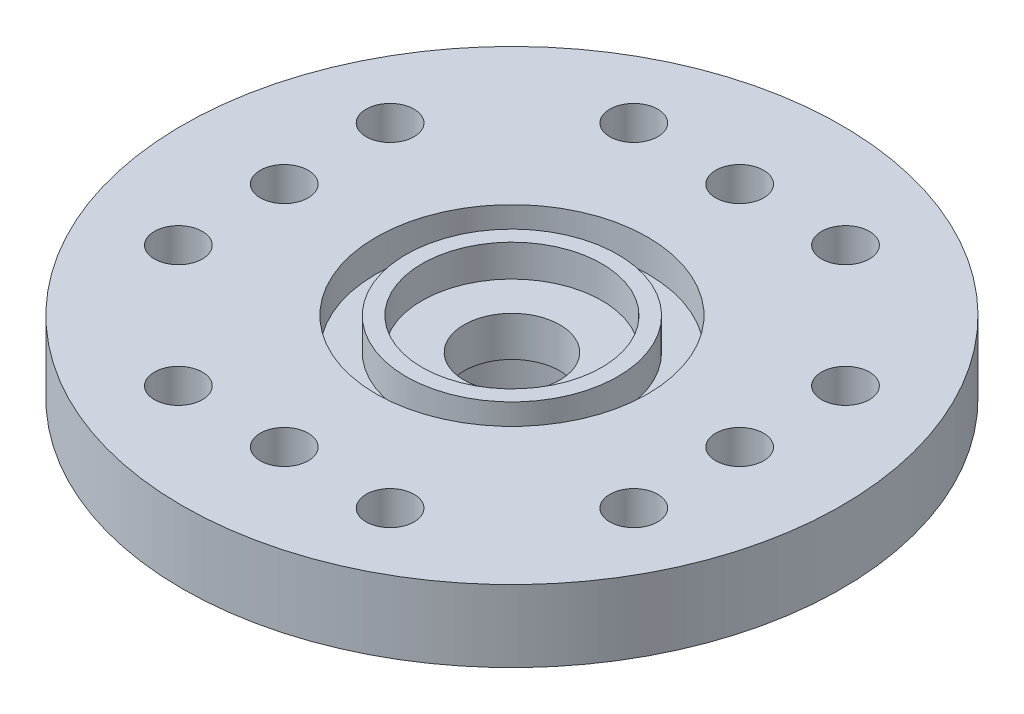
from build123d import *

# Parameters (mm, degrees)
SKETCH1_R           = 10.4775
SKETCH1_R_2         = 0.762
SKETCH1_R_3         = 1.524
BOSS_EXTRUDE1_DEPTH = 2.286
CUT_EXTRUDE1_START  = -1.016
SKETCH2_R           = 4.318
SKETCH2_R_2         = 3.3655
SKETCH2_R_3         = 2.8575
SKETCH2_R_4         = 1.524
CUT_EXTRUDE1_DEPTH  = 1.016
SKETCH3_R           = 4.3815
SKETCH3_R_2         = 3.175
BOSS_EXTRUDE2_DEPTH = 3.048


with BuildPart() as part:
    # Sketch1 → Boss-Extrude1 (new body)
    with BuildSketch(Plane(origin=(0, 0, 0), x_dir=(1, 0, 0), z_dir=(0, 1, 0))):
        with Locations(Location((0, 0, 0), (0, 0, 270))):
            Circle(SKETCH1_R)
        with Locations(Location((0, 7.239, 0), (0, 0, 270))):
            Circle(SKETCH1_R_2, mode=Mode.SUBTRACT)
        with Locations(Location((3.3655, 7.239, 0), (0, 0, 270))):
            Circle(SKETCH1_R_2, mode=Mode.SUBTRACT)
        with Locations(Location((-3.3655, 7.239, 0), (0, 0, 270))):
            Circle(SKETCH1_R_2, mode=Mode.SUBTRACT)
        with Locations(Location((0, 0, 0), (0, 0, 270))):
            Circle(SKETCH1_R_3, mode=Mode.SUBTRACT)
        with Locations(Location((7.239, -3.3655, 0), (0, 0, 270))):
            Circle(SKETCH1_R_2, mode=Mode.SUBTRACT)
        with Locations(Location((7.239, 0, 0), (0, 0, 270))):
            Circle(SKETCH1_R_2, mode=Mode.SUBTRACT)
        with Locations(Location((7.239, 3.3655, 0), (0, 0, 270))):
            Circle(SKETCH1_R_2, mode=Mode.SUBTRACT)
        with Locations(Location((-3.3655, -7.239, 0), (0, 0, 270))):
            Circle(SKETCH1_R_2, mode=Mode.SUBTRACT)
        with Locations(Location((0, -7.239, 0), (0, 0, 270))):
            Circle(SKETCH1_R_2, mode=Mode.SUBTRACT)
        with Locations(Location((3.3655, -7.239, 0), (0, 0, 270))):
            Circle(SKETCH1_R_2, mode=Mode.SUBTRACT)
        with Locations(Location((-7.239, 3.3655, 0), (0, 0, 270))):
            Circle(SKETCH1_R_2, mode=Mode.SUBTRACT)
        with Locations(Location((-7.239, 0, 0), (0, 0, 270))):
            Circle(SKETCH1_R_2, mode=Mode.SUBTRACT)
        with Locations(Location((-7.239, -3.3655, 0), (0, 0, 270))):
            Circle(SKETCH1_R_2, mode=Mode.SUBTRACT)
    extrude(amount=BOSS_EXTRUDE1_DEPTH)

    # Sketch2 → Cut-Extrude1 (cut)
    # profile 1 of 2: a face of its own
    with BuildSketch(Plane(origin=(0, 2.286, 0), x_dir=(1, 0, 0), z_dir=(0, 1, 0)).offset(CUT_EXTRUDE1_START)):
        with Locations(Location((0, 0, 0), (0, 0, 270))):
            Circle(SKETCH2_R)
        with Locations(Location((0, 0, 0), (0, 0, 270))):
            Circle(SKETCH2_R_2, mode=Mode.SUBTRACT)
    # profile 2 of 2: a face of its own
    with BuildSketch(Plane(origin=(0, 2.286, 0), x_dir=(1, 0, 0), z_dir=(0, 1, 0)).offset(CUT_EXTRUDE1_START)):
        with Locations(Location((0, 0, 0), (0, 0, 270))):
            Circle(SKETCH2_R_3)
        with Locations(Location((0, 0, 0), (0, 0, 270))):
            Circle(SKETCH2_R_4, mode=Mode.SUBTRACT)
    extrude(amount=CUT_EXTRUDE1_DEPTH, mode=Mode.SUBTRACT)

    # Sketch3 → Boss-Extrude2 (add)
    with BuildSketch(Plane.XZ):
        with Locations(Location((0, 0, 0), (0, 0, 90))):
            Circle(SKETCH3_R)
        with Locations(Location((0, 0, 0), (0, 0, 90))):
            Circle(SKETCH3_R_2, mode=Mode.SUBTRACT)
    extrude(amount=BOSS_EXTRUDE2_DEPTH)


solid = part.part
